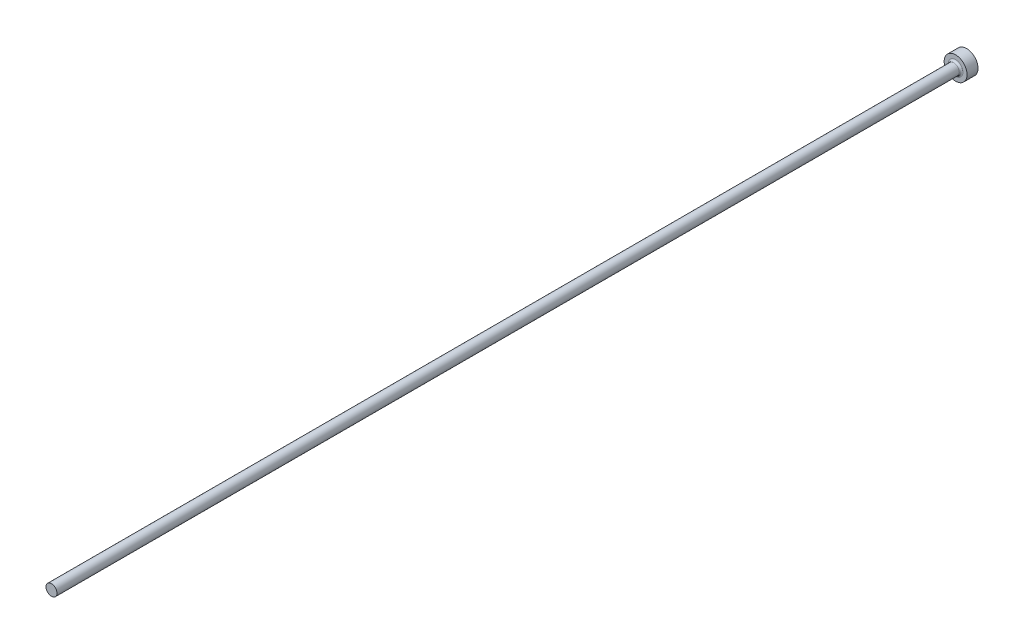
from build123d import *

# Parameters (mm, degrees)
FILLET1_R = 0.2


with BuildPart() as part:
    # FV → Revolve1 (revolve)
    with BuildSketch(Plane(origin=(0, 0, 0), x_dir=(1, 0, 0), z_dir=(0, 1, 0)), mode=Mode.PRIVATE) as revolve1_sk:
        Polygon((0, 0), (1.25, 0), (1.25, -1.2), (0.6, -1.2), (0.6, -100), (0, -100), align=None)
    revolve(revolve1_sk.sketch.rotate(Axis((0, 0, -9.033228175), (0, 0, 1)), 180), axis=Axis((0, 0, -9.033228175), (0, 0, 1)))

    # Fillet1
    fillet1_edges = [part.edges().sort_by_distance(p)[0] for p in [
        (0.6, 0, 1.2),
    ]]
    fillet(fillet1_edges, radius=FILLET1_R)


solid = part.part
